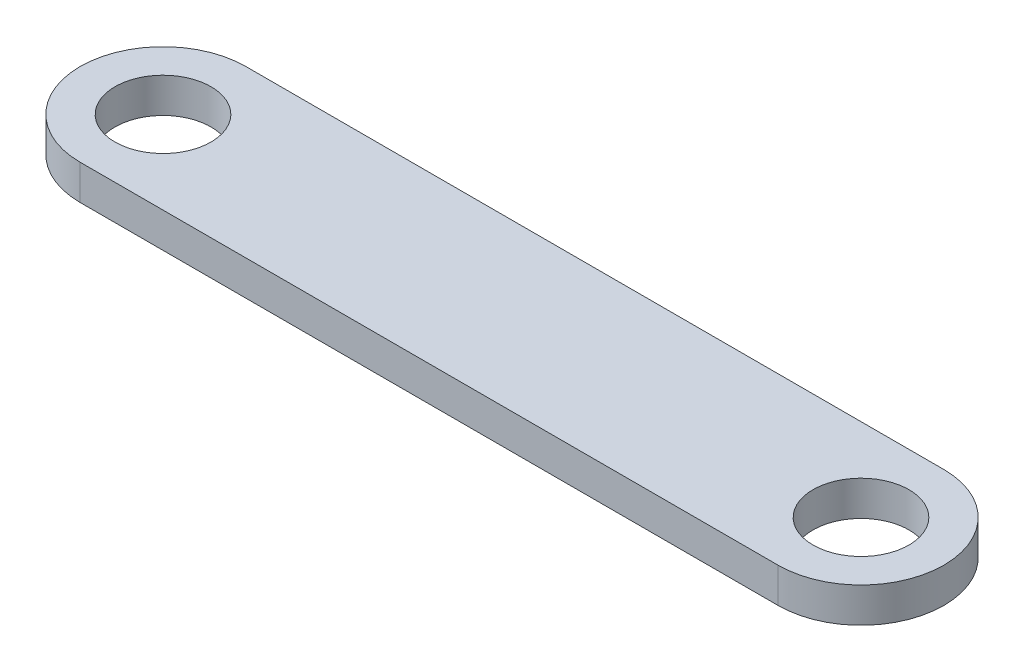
from build123d import *

# Parameters (mm, degrees)
SKETCH1_R           = 2.75
BOSS_EXTRUDE1_DEPTH = 2


with BuildPart() as part:
    # Sketch1 → Boss-Extrude1 (new body)
    with BuildSketch(Plane(origin=(0, 0, 0), x_dir=(1, 0, 0), z_dir=(0, 1, 0))):
        with BuildLine():
            Line((-20, 4.75), (20, 4.75))
            ThreePointArc((20, 4.75), (24.75, 0), (20, -4.75))
            Line((20, -4.75), (-20, -4.75))
            ThreePointArc((-20, -4.75), (-24.75, 0), (-20, 4.75))
        make_face()
        with Locations(Location((-20, 0, 0), (0, 0, 270))):
            Circle(SKETCH1_R, mode=Mode.SUBTRACT)
        with Locations(Location((20, 0, 0), (0, 0, 270))):
            Circle(SKETCH1_R, mode=Mode.SUBTRACT)
    extrude(amount=BOSS_EXTRUDE1_DEPTH)


solid = part.part
